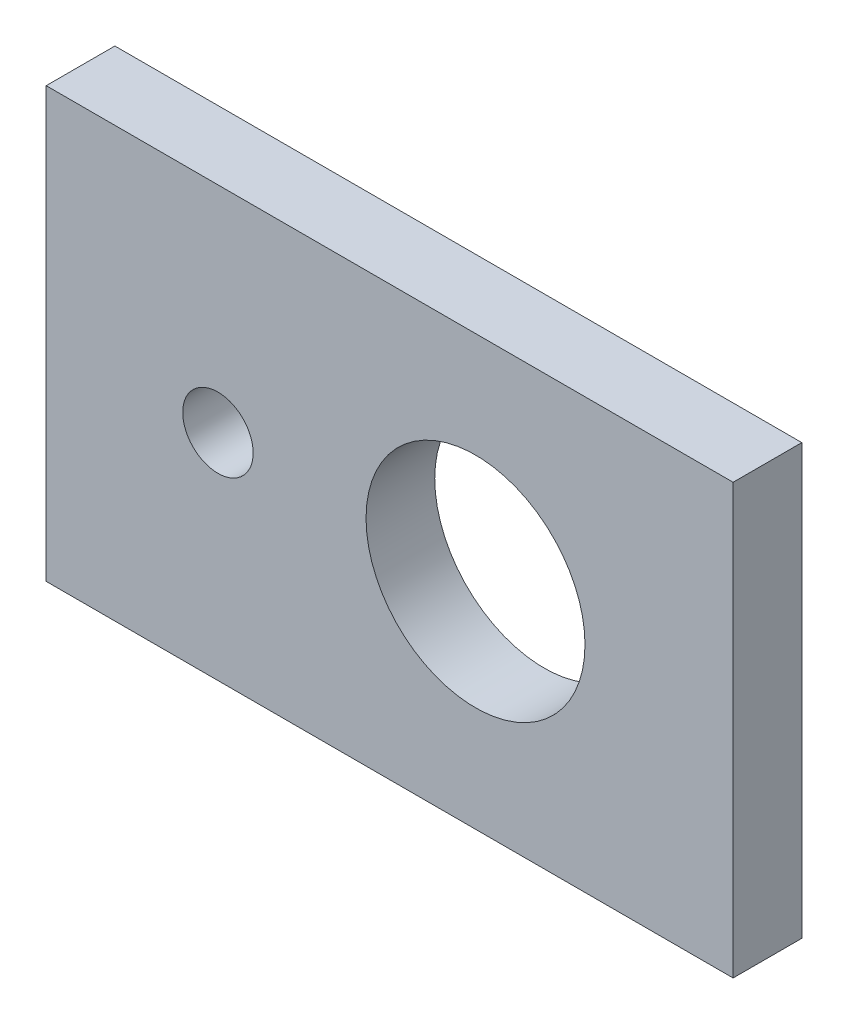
ISO-10303-21;
HEADER;
FILE_DESCRIPTION(('STEP AP214'),'2;1');
FILE_NAME('part.step','',(''),(''),'','','');
FILE_SCHEMA(('AUTOMOTIVE_DESIGN { 1 0 10303 214 1 1 1 1 }'));
ENDSEC;
DATA;
#1=APPLICATION_CONTEXT('core data for automotive mechanical design processes');
#2=APPLICATION_PROTOCOL_DEFINITION('international standard','automotive_design',2000,#1);
#3=PRODUCT_CONTEXT('',#1,'mechanical');
#4=PRODUCT('Part','Part','',(#3));
#5=PRODUCT_RELATED_PRODUCT_CATEGORY('part','',(#4));
#6=PRODUCT_DEFINITION_FORMATION('','',#4);
#7=PRODUCT_DEFINITION_CONTEXT('part definition',#1,'design');
#8=PRODUCT_DEFINITION('design','',#6,#7);
#9=PRODUCT_DEFINITION_SHAPE('','',#8);
#10=(LENGTH_UNIT() NAMED_UNIT(*) SI_UNIT(.MILLI.,.METRE.));
#11=(NAMED_UNIT(*) PLANE_ANGLE_UNIT() SI_UNIT($,.RADIAN.));
#12=(NAMED_UNIT(*) SI_UNIT($,.STERADIAN.) SOLID_ANGLE_UNIT());
#13=UNCERTAINTY_MEASURE_WITH_UNIT(LENGTH_MEASURE(1.E-05),#10,'distance_accuracy_value','');
#14=(GEOMETRIC_REPRESENTATION_CONTEXT(3) GLOBAL_UNCERTAINTY_ASSIGNED_CONTEXT((#13)) GLOBAL_UNIT_ASSIGNED_CONTEXT((#10,
#11,#12)) REPRESENTATION_CONTEXT('',''));
#15=CARTESIAN_POINT('',(0.,0.,0.));
#16=DIRECTION('',(0.,0.,1.));
#17=DIRECTION('',(1.,0.,0.));
#18=AXIS2_PLACEMENT_3D('',#15,#16,#17);
#19=CARTESIAN_POINT('',(0.,50.,8.));
#20=DIRECTION('',(0.,0.,1.));
#21=DIRECTION('',(1.,0.,0.));
#22=AXIS2_PLACEMENT_3D('',#19,#20,#21);
#23=PLANE('',#22);
#24=CARTESIAN_POINT('',(-30.,25.,8.));
#25=DIRECTION('',(0.,0.,1.));
#26=DIRECTION('',(1.,0.,0.));
#27=AXIS2_PLACEMENT_3D('',#24,#25,#26);
#28=CIRCLE('',#27,12.75);
#29=CARTESIAN_POINT('',(-17.25,25.,8.));
#30=VERTEX_POINT('',#29);
#31=EDGE_CURVE('E88',#30,#30,#28,.T.);
#32=ORIENTED_EDGE('',*,*,#31,.F.);
#33=EDGE_LOOP('',(#32));
#34=FACE_BOUND('',#33,.T.);
#35=DIRECTION('',(0.,1.,0.));
#36=VECTOR('',#35,1.);
#37=CARTESIAN_POINT('',(0.,0.,8.));
#38=LINE('',#37,#36);
#39=CARTESIAN_POINT('',(0.,0.,8.));
#40=VERTEX_POINT('',#39);
#41=CARTESIAN_POINT('',(0.,50.,8.));
#42=VERTEX_POINT('',#41);
#43=EDGE_CURVE('E98',#40,#42,#38,.T.);
#44=ORIENTED_EDGE('',*,*,#43,.T.);
#45=DIRECTION('',(-1.,0.,0.));
#46=VECTOR('',#45,1.);
#47=CARTESIAN_POINT('',(0.,50.,8.));
#48=LINE('',#47,#46);
#49=CARTESIAN_POINT('',(-80.,50.,8.));
#50=VERTEX_POINT('',#49);
#51=EDGE_CURVE('E83',#42,#50,#48,.T.);
#52=ORIENTED_EDGE('',*,*,#51,.T.);
#53=DIRECTION('',(0.,-1.,0.));
#54=VECTOR('',#53,1.);
#55=CARTESIAN_POINT('',(-80.,0.,8.));
#56=LINE('',#55,#54);
#57=CARTESIAN_POINT('',(-80.,0.,8.));
#58=VERTEX_POINT('',#57);
#59=EDGE_CURVE('E49',#50,#58,#56,.T.);
#60=ORIENTED_EDGE('',*,*,#59,.T.);
#61=DIRECTION('',(1.,0.,0.));
#62=VECTOR('',#61,1.);
#63=CARTESIAN_POINT('',(0.,0.,8.));
#64=LINE('',#63,#62);
#65=EDGE_CURVE('E44',#58,#40,#64,.T.);
#66=ORIENTED_EDGE('',*,*,#65,.T.);
#67=EDGE_LOOP('',(#44,#52,#60,#66));
#68=FACE_BOUND('',#67,.T.);
#69=CARTESIAN_POINT('',(-60.,25.,8.));
#70=DIRECTION('',(0.,0.,1.));
#71=DIRECTION('',(1.,0.,0.));
#72=AXIS2_PLACEMENT_3D('',#69,#70,#71);
#73=CIRCLE('',#72,4.1);
#74=CARTESIAN_POINT('',(-55.9,25.,8.));
#75=VERTEX_POINT('',#74);
#76=EDGE_CURVE('E116',#75,#75,#73,.T.);
#77=ORIENTED_EDGE('',*,*,#76,.F.);
#78=EDGE_LOOP('',(#77));
#79=FACE_BOUND('',#78,.T.);
#80=ADVANCED_FACE('F29',(#34,#68,#79),#23,.T.);
#81=CARTESIAN_POINT('',(0.,50.,0.));
#82=DIRECTION('',(0.,0.,1.));
#83=DIRECTION('',(1.,0.,0.));
#84=AXIS2_PLACEMENT_3D('',#81,#82,#83);
#85=PLANE('',#84);
#86=CARTESIAN_POINT('',(-30.,25.,0.));
#87=DIRECTION('',(0.,0.,1.));
#88=DIRECTION('',(1.,0.,0.));
#89=AXIS2_PLACEMENT_3D('',#86,#87,#88);
#90=CIRCLE('',#89,12.75);
#91=CARTESIAN_POINT('',(-17.25,25.,0.));
#92=VERTEX_POINT('',#91);
#93=EDGE_CURVE('E91',#92,#92,#90,.T.);
#94=ORIENTED_EDGE('',*,*,#93,.T.);
#95=EDGE_LOOP('',(#94));
#96=FACE_BOUND('',#95,.T.);
#97=DIRECTION('',(0.,1.,0.));
#98=VECTOR('',#97,1.);
#99=CARTESIAN_POINT('',(0.,0.,0.));
#100=LINE('',#99,#98);
#101=CARTESIAN_POINT('',(0.,0.,0.));
#102=VERTEX_POINT('',#101);
#103=CARTESIAN_POINT('',(0.,50.,0.));
#104=VERTEX_POINT('',#103);
#105=EDGE_CURVE('E75',#102,#104,#100,.T.);
#106=ORIENTED_EDGE('',*,*,#105,.F.);
#107=DIRECTION('',(1.,0.,0.));
#108=VECTOR('',#107,1.);
#109=CARTESIAN_POINT('',(0.,0.,0.));
#110=LINE('',#109,#108);
#111=CARTESIAN_POINT('',(-80.,0.,0.));
#112=VERTEX_POINT('',#111);
#113=EDGE_CURVE('E96',#112,#102,#110,.T.);
#114=ORIENTED_EDGE('',*,*,#113,.F.);
#115=DIRECTION('',(0.,-1.,0.));
#116=VECTOR('',#115,1.);
#117=CARTESIAN_POINT('',(-80.,0.,0.));
#118=LINE('',#117,#116);
#119=CARTESIAN_POINT('',(-80.,50.,0.));
#120=VERTEX_POINT('',#119);
#121=EDGE_CURVE('E76',#120,#112,#118,.T.);
#122=ORIENTED_EDGE('',*,*,#121,.F.);
#123=DIRECTION('',(-1.,0.,0.));
#124=VECTOR('',#123,1.);
#125=CARTESIAN_POINT('',(0.,50.,0.));
#126=LINE('',#125,#124);
#127=EDGE_CURVE('E70',#104,#120,#126,.T.);
#128=ORIENTED_EDGE('',*,*,#127,.F.);
#129=EDGE_LOOP('',(#106,#114,#122,#128));
#130=FACE_BOUND('',#129,.T.);
#131=CARTESIAN_POINT('',(-60.,25.,0.));
#132=DIRECTION('',(0.,0.,1.));
#133=DIRECTION('',(1.,0.,0.));
#134=AXIS2_PLACEMENT_3D('',#131,#132,#133);
#135=CIRCLE('',#134,4.1);
#136=CARTESIAN_POINT('',(-55.9,25.,0.));
#137=VERTEX_POINT('',#136);
#138=EDGE_CURVE('E118',#137,#137,#135,.T.);
#139=ORIENTED_EDGE('',*,*,#138,.T.);
#140=EDGE_LOOP('',(#139));
#141=FACE_BOUND('',#140,.T.);
#142=ADVANCED_FACE('F71',(#96,#130,#141),#85,.F.);
#143=CARTESIAN_POINT('',(0.,0.,8.));
#144=DIRECTION('',(-1.,0.,0.));
#145=DIRECTION('',(0.,0.,1.));
#146=AXIS2_PLACEMENT_3D('',#143,#144,#145);
#147=PLANE('',#146);
#148=ORIENTED_EDGE('',*,*,#105,.T.);
#149=DIRECTION('',(0.,0.,-1.));
#150=VECTOR('',#149,1.);
#151=CARTESIAN_POINT('',(0.,50.,8.));
#152=LINE('',#151,#150);
#153=EDGE_CURVE('E11',#42,#104,#152,.T.);
#154=ORIENTED_EDGE('',*,*,#153,.F.);
#155=ORIENTED_EDGE('',*,*,#43,.F.);
#156=DIRECTION('',(0.,0.,-1.));
#157=VECTOR('',#156,1.);
#158=CARTESIAN_POINT('',(0.,0.,8.));
#159=LINE('',#158,#157);
#160=EDGE_CURVE('E87',#40,#102,#159,.T.);
#161=ORIENTED_EDGE('',*,*,#160,.T.);
#162=EDGE_LOOP('',(#148,#154,#155,#161));
#163=FACE_BOUND('',#162,.T.);
#164=ADVANCED_FACE('F31',(#163),#147,.F.);
#165=CARTESIAN_POINT('',(0.,50.,8.));
#166=DIRECTION('',(0.,-1.,0.));
#167=DIRECTION('',(1.,0.,0.));
#168=AXIS2_PLACEMENT_3D('',#165,#166,#167);
#169=PLANE('',#168);
#170=ORIENTED_EDGE('',*,*,#127,.T.);
#171=DIRECTION('',(0.,0.,-1.));
#172=VECTOR('',#171,1.);
#173=CARTESIAN_POINT('',(-80.,50.,8.));
#174=LINE('',#173,#172);
#175=EDGE_CURVE('E37',#50,#120,#174,.T.);
#176=ORIENTED_EDGE('',*,*,#175,.F.);
#177=ORIENTED_EDGE('',*,*,#51,.F.);
#178=ORIENTED_EDGE('',*,*,#153,.T.);
#179=EDGE_LOOP('',(#170,#176,#177,#178));
#180=FACE_BOUND('',#179,.T.);
#181=ADVANCED_FACE('F82',(#180),#169,.F.);
#182=CARTESIAN_POINT('',(-80.,0.,8.));
#183=DIRECTION('',(1.,0.,0.));
#184=DIRECTION('',(0.,0.,-1.));
#185=AXIS2_PLACEMENT_3D('',#182,#183,#184);
#186=PLANE('',#185);
#187=ORIENTED_EDGE('',*,*,#121,.T.);
#188=DIRECTION('',(0.,0.,-1.));
#189=VECTOR('',#188,1.);
#190=CARTESIAN_POINT('',(-80.,0.,8.));
#191=LINE('',#190,#189);
#192=EDGE_CURVE('E104',#58,#112,#191,.T.);
#193=ORIENTED_EDGE('',*,*,#192,.F.);
#194=ORIENTED_EDGE('',*,*,#59,.F.);
#195=ORIENTED_EDGE('',*,*,#175,.T.);
#196=EDGE_LOOP('',(#187,#193,#194,#195));
#197=FACE_BOUND('',#196,.T.);
#198=ADVANCED_FACE('F107',(#197),#186,.F.);
#199=CARTESIAN_POINT('',(0.,0.,8.));
#200=DIRECTION('',(0.,1.,0.));
#201=DIRECTION('',(-1.,0.,0.));
#202=AXIS2_PLACEMENT_3D('',#199,#200,#201);
#203=PLANE('',#202);
#204=ORIENTED_EDGE('',*,*,#113,.T.);
#205=ORIENTED_EDGE('',*,*,#160,.F.);
#206=ORIENTED_EDGE('',*,*,#65,.F.);
#207=ORIENTED_EDGE('',*,*,#192,.T.);
#208=EDGE_LOOP('',(#204,#205,#206,#207));
#209=FACE_BOUND('',#208,.T.);
#210=ADVANCED_FACE('F109',(#209),#203,.F.);
#211=CARTESIAN_POINT('',(-30.,25.,8.));
#212=DIRECTION('',(0.,0.,-1.));
#213=DIRECTION('',(-1.,0.,0.));
#214=AXIS2_PLACEMENT_3D('',#211,#212,#213);
#215=CYLINDRICAL_SURFACE('',#214,12.75);
#216=ORIENTED_EDGE('',*,*,#31,.T.);
#217=EDGE_LOOP('',(#216));
#218=FACE_BOUND('',#217,.T.);
#219=ORIENTED_EDGE('',*,*,#93,.F.);
#220=EDGE_LOOP('',(#219));
#221=FACE_BOUND('',#220,.T.);
#222=ADVANCED_FACE('F127',(#218,#221),#215,.F.);
#223=CARTESIAN_POINT('',(-60.,25.,8.));
#224=DIRECTION('',(0.,0.,-1.));
#225=DIRECTION('',(-1.,0.,0.));
#226=AXIS2_PLACEMENT_3D('',#223,#224,#225);
#227=CYLINDRICAL_SURFACE('',#226,4.1);
#228=ORIENTED_EDGE('',*,*,#76,.T.);
#229=EDGE_LOOP('',(#228));
#230=FACE_BOUND('',#229,.T.);
#231=ORIENTED_EDGE('',*,*,#138,.F.);
#232=EDGE_LOOP('',(#231));
#233=FACE_BOUND('',#232,.T.);
#234=ADVANCED_FACE('F125',(#230,#233),#227,.F.);
#235=CLOSED_SHELL('',(#80,#142,#164,#181,#198,#210,#222,#234));
#236=MANIFOLD_SOLID_BREP('B2',#235);
#237=ADVANCED_BREP_SHAPE_REPRESENTATION('',(#18,#236),#14);
#238=SHAPE_DEFINITION_REPRESENTATION(#9,#237);
ENDSEC;
END-ISO-10303-21;
